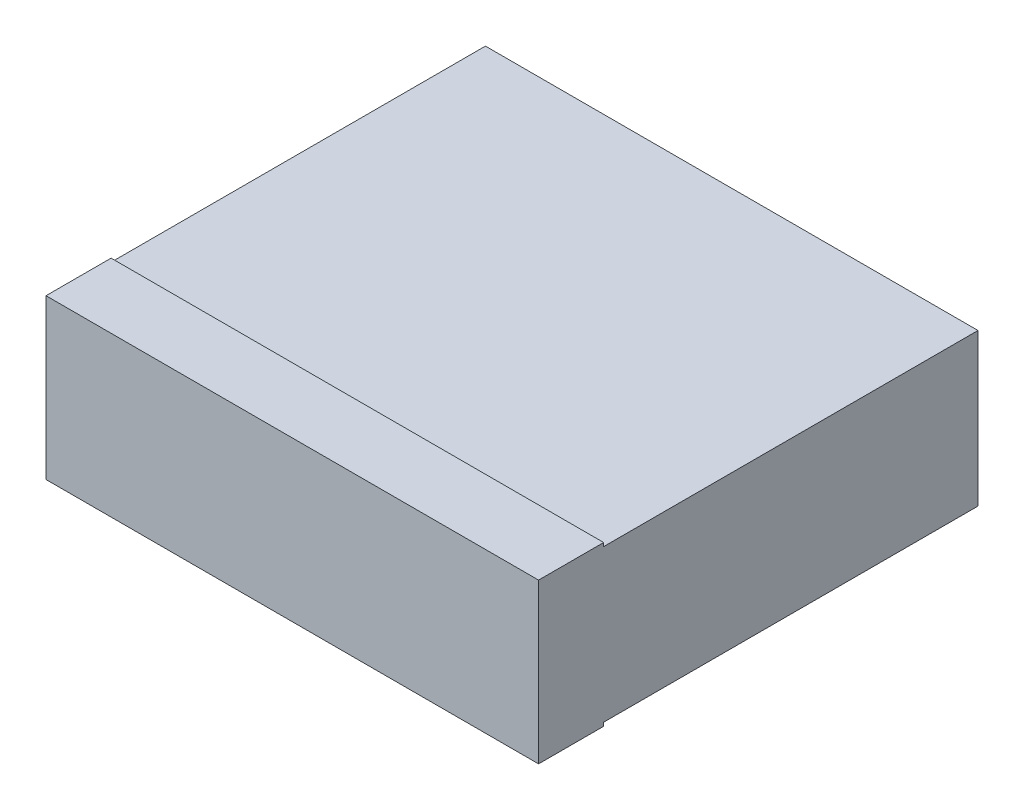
ISO-10303-21;
HEADER;
FILE_DESCRIPTION(('STEP AP214'),'2;1');
FILE_NAME('part.step','',(''),(''),'','','');
FILE_SCHEMA(('AUTOMOTIVE_DESIGN { 1 0 10303 214 1 1 1 1 }'));
ENDSEC;
DATA;
#1=APPLICATION_CONTEXT('core data for automotive mechanical design processes');
#2=APPLICATION_PROTOCOL_DEFINITION('international standard','automotive_design',2000,#1);
#3=PRODUCT_CONTEXT('',#1,'mechanical');
#4=PRODUCT('Part','Part','',(#3));
#5=PRODUCT_RELATED_PRODUCT_CATEGORY('part','',(#4));
#6=PRODUCT_DEFINITION_FORMATION('','',#4);
#7=PRODUCT_DEFINITION_CONTEXT('part definition',#1,'design');
#8=PRODUCT_DEFINITION('design','',#6,#7);
#9=PRODUCT_DEFINITION_SHAPE('','',#8);
#10=(LENGTH_UNIT() NAMED_UNIT(*) SI_UNIT(.MILLI.,.METRE.));
#11=(NAMED_UNIT(*) PLANE_ANGLE_UNIT() SI_UNIT($,.RADIAN.));
#12=(NAMED_UNIT(*) SI_UNIT($,.STERADIAN.) SOLID_ANGLE_UNIT());
#13=UNCERTAINTY_MEASURE_WITH_UNIT(LENGTH_MEASURE(1.E-05),#10,'distance_accuracy_value','');
#14=(GEOMETRIC_REPRESENTATION_CONTEXT(3) GLOBAL_UNCERTAINTY_ASSIGNED_CONTEXT((#13)) GLOBAL_UNIT_ASSIGNED_CONTEXT((#10,
#11,#12)) REPRESENTATION_CONTEXT('',''));
#15=CARTESIAN_POINT('',(0.,0.,0.));
#16=DIRECTION('',(0.,0.,1.));
#17=DIRECTION('',(1.,0.,0.));
#18=AXIS2_PLACEMENT_3D('',#15,#16,#17);
#19=CARTESIAN_POINT('',(-79.375,24.511,120.65));
#20=DIRECTION('',(0.,1.,0.));
#21=DIRECTION('',(0.,0.,1.));
#22=AXIS2_PLACEMENT_3D('',#19,#20,#21);
#23=PLANE('',#22);
#24=DIRECTION('',(1.,0.,0.));
#25=VECTOR('',#24,1.);
#26=CARTESIAN_POINT('',(-79.375,24.511,0.));
#27=LINE('',#26,#25);
#28=CARTESIAN_POINT('',(-79.375,24.511,0.));
#29=VERTEX_POINT('',#28);
#30=CARTESIAN_POINT('',(79.375,24.511,0.));
#31=VERTEX_POINT('',#30);
#32=EDGE_CURVE('E132',#29,#31,#27,.T.);
#33=ORIENTED_EDGE('',*,*,#32,.F.);
#34=DIRECTION('',(0.,0.,-1.));
#35=VECTOR('',#34,1.);
#36=CARTESIAN_POINT('',(-79.375,24.511,120.65));
#37=LINE('',#36,#35);
#38=CARTESIAN_POINT('',(-79.375,24.511,120.65));
#39=VERTEX_POINT('',#38);
#40=EDGE_CURVE('E11',#39,#29,#37,.T.);
#41=ORIENTED_EDGE('',*,*,#40,.F.);
#42=DIRECTION('',(1.,0.,0.));
#43=VECTOR('',#42,1.);
#44=CARTESIAN_POINT('',(-79.375,24.511,120.65));
#45=LINE('',#44,#43);
#46=CARTESIAN_POINT('',(79.375,24.511,120.65));
#47=VERTEX_POINT('',#46);
#48=EDGE_CURVE('E141',#39,#47,#45,.T.);
#49=ORIENTED_EDGE('',*,*,#48,.T.);
#50=DIRECTION('',(0.,0.,-1.));
#51=VECTOR('',#50,1.);
#52=CARTESIAN_POINT('',(79.375,24.511,120.65));
#53=LINE('',#52,#51);
#54=EDGE_CURVE('E42',#47,#31,#53,.T.);
#55=ORIENTED_EDGE('',*,*,#54,.T.);
#56=EDGE_LOOP('',(#33,#41,#49,#55));
#57=FACE_BOUND('',#56,.T.);
#58=ADVANCED_FACE('F39',(#57),#23,.T.);
#59=CARTESIAN_POINT('',(-79.375,-24.511,120.65));
#60=DIRECTION('',(-1.,0.,0.));
#61=DIRECTION('',(0.,0.,1.));
#62=AXIS2_PLACEMENT_3D('',#59,#60,#61);
#63=PLANE('',#62);
#64=DIRECTION('',(0.,1.,0.));
#65=VECTOR('',#64,1.);
#66=CARTESIAN_POINT('',(-79.375,-24.511,0.));
#67=LINE('',#66,#65);
#68=CARTESIAN_POINT('',(-79.375,-24.511,0.));
#69=VERTEX_POINT('',#68);
#70=EDGE_CURVE('E144',#69,#29,#67,.T.);
#71=ORIENTED_EDGE('',*,*,#70,.F.);
#72=DIRECTION('',(0.,0.,-1.));
#73=VECTOR('',#72,1.);
#74=CARTESIAN_POINT('',(-79.375,-24.511,120.65));
#75=LINE('',#74,#73);
#76=CARTESIAN_POINT('',(-79.375,-24.511,120.65));
#77=VERTEX_POINT('',#76);
#78=EDGE_CURVE('E48',#77,#69,#75,.T.);
#79=ORIENTED_EDGE('',*,*,#78,.F.);
#80=DIRECTION('',(0.,-1.,0.));
#81=VECTOR('',#80,1.);
#82=CARTESIAN_POINT('',(-79.375,-25.654,120.65));
#83=LINE('',#82,#81);
#84=CARTESIAN_POINT('',(-79.375,-25.654,120.65));
#85=VERTEX_POINT('',#84);
#86=EDGE_CURVE('E161',#77,#85,#83,.T.);
#87=ORIENTED_EDGE('',*,*,#86,.T.);
#88=DIRECTION('',(0.,0.,-1.));
#89=VECTOR('',#88,1.);
#90=CARTESIAN_POINT('',(-79.375,-25.654,141.6304));
#91=LINE('',#90,#89);
#92=CARTESIAN_POINT('',(-79.375,-25.654,141.6304));
#93=VERTEX_POINT('',#92);
#94=EDGE_CURVE('E137',#93,#85,#91,.T.);
#95=ORIENTED_EDGE('',*,*,#94,.F.);
#96=DIRECTION('',(0.,-1.,0.));
#97=VECTOR('',#96,1.);
#98=CARTESIAN_POINT('',(-79.375,-25.654,141.6304));
#99=LINE('',#98,#97);
#100=CARTESIAN_POINT('',(-79.375,25.654,141.6304));
#101=VERTEX_POINT('',#100);
#102=EDGE_CURVE('E117',#101,#93,#99,.T.);
#103=ORIENTED_EDGE('',*,*,#102,.F.);
#104=DIRECTION('',(0.,0.,-1.));
#105=VECTOR('',#104,1.);
#106=CARTESIAN_POINT('',(-79.375,25.654,141.6304));
#107=LINE('',#106,#105);
#108=CARTESIAN_POINT('',(-79.375,25.654,120.65));
#109=VERTEX_POINT('',#108);
#110=EDGE_CURVE('E114',#101,#109,#107,.T.);
#111=ORIENTED_EDGE('',*,*,#110,.T.);
#112=EDGE_CURVE('E168',#109,#39,#83,.T.);
#113=ORIENTED_EDGE('',*,*,#112,.T.);
#114=ORIENTED_EDGE('',*,*,#40,.T.);
#115=EDGE_LOOP('',(#71,#79,#87,#95,#103,#111,#113,#114));
#116=FACE_BOUND('',#115,.T.);
#117=ADVANCED_FACE('F158',(#116),#63,.T.);
#118=CARTESIAN_POINT('',(-79.375,-24.511,120.65));
#119=DIRECTION('',(0.,1.,0.));
#120=DIRECTION('',(0.,0.,1.));
#121=AXIS2_PLACEMENT_3D('',#118,#119,#120);
#122=PLANE('',#121);
#123=DIRECTION('',(1.,0.,0.));
#124=VECTOR('',#123,1.);
#125=CARTESIAN_POINT('',(-79.375,-24.511,0.));
#126=LINE('',#125,#124);
#127=CARTESIAN_POINT('',(79.375,-24.511,0.));
#128=VERTEX_POINT('',#127);
#129=EDGE_CURVE('E148',#69,#128,#126,.T.);
#130=ORIENTED_EDGE('',*,*,#129,.T.);
#131=DIRECTION('',(0.,0.,-1.));
#132=VECTOR('',#131,1.);
#133=CARTESIAN_POINT('',(79.375,-24.511,120.65));
#134=LINE('',#133,#132);
#135=CARTESIAN_POINT('',(79.375,-24.511,120.65));
#136=VERTEX_POINT('',#135);
#137=EDGE_CURVE('E152',#136,#128,#134,.T.);
#138=ORIENTED_EDGE('',*,*,#137,.F.);
#139=DIRECTION('',(1.,0.,0.));
#140=VECTOR('',#139,1.);
#141=CARTESIAN_POINT('',(-79.375,-24.511,120.65));
#142=LINE('',#141,#140);
#143=EDGE_CURVE('E143',#77,#136,#142,.T.);
#144=ORIENTED_EDGE('',*,*,#143,.F.);
#145=ORIENTED_EDGE('',*,*,#78,.T.);
#146=EDGE_LOOP('',(#130,#138,#144,#145));
#147=FACE_BOUND('',#146,.T.);
#148=ADVANCED_FACE('F163',(#147),#122,.F.);
#149=CARTESIAN_POINT('',(79.375,-24.511,120.65));
#150=DIRECTION('',(-1.,0.,0.));
#151=DIRECTION('',(0.,0.,1.));
#152=AXIS2_PLACEMENT_3D('',#149,#150,#151);
#153=PLANE('',#152);
#154=DIRECTION('',(0.,1.,0.));
#155=VECTOR('',#154,1.);
#156=CARTESIAN_POINT('',(79.375,-24.511,0.));
#157=LINE('',#156,#155);
#158=EDGE_CURVE('E135',#128,#31,#157,.T.);
#159=ORIENTED_EDGE('',*,*,#158,.T.);
#160=ORIENTED_EDGE('',*,*,#54,.F.);
#161=DIRECTION('',(0.,1.,0.));
#162=VECTOR('',#161,1.);
#163=CARTESIAN_POINT('',(79.375,-25.654,120.65));
#164=LINE('',#163,#162);
#165=CARTESIAN_POINT('',(79.375,25.654,120.65));
#166=VERTEX_POINT('',#165);
#167=EDGE_CURVE('E130',#47,#166,#164,.T.);
#168=ORIENTED_EDGE('',*,*,#167,.T.);
#169=DIRECTION('',(0.,0.,-1.));
#170=VECTOR('',#169,1.);
#171=CARTESIAN_POINT('',(79.375,25.654,141.6304));
#172=LINE('',#171,#170);
#173=CARTESIAN_POINT('',(79.375,25.654,141.6304));
#174=VERTEX_POINT('',#173);
#175=EDGE_CURVE('E112',#174,#166,#172,.T.);
#176=ORIENTED_EDGE('',*,*,#175,.F.);
#177=DIRECTION('',(0.,1.,0.));
#178=VECTOR('',#177,1.);
#179=CARTESIAN_POINT('',(79.375,-25.654,141.6304));
#180=LINE('',#179,#178);
#181=CARTESIAN_POINT('',(79.375,-25.654,141.6304));
#182=VERTEX_POINT('',#181);
#183=EDGE_CURVE('E118',#182,#174,#180,.T.);
#184=ORIENTED_EDGE('',*,*,#183,.F.);
#185=DIRECTION('',(0.,0.,-1.));
#186=VECTOR('',#185,1.);
#187=CARTESIAN_POINT('',(79.375,-25.654,141.6304));
#188=LINE('',#187,#186);
#189=CARTESIAN_POINT('',(79.375,-25.654,120.65));
#190=VERTEX_POINT('',#189);
#191=EDGE_CURVE('E176',#182,#190,#188,.T.);
#192=ORIENTED_EDGE('',*,*,#191,.T.);
#193=EDGE_CURVE('E171',#190,#136,#164,.T.);
#194=ORIENTED_EDGE('',*,*,#193,.T.);
#195=ORIENTED_EDGE('',*,*,#137,.T.);
#196=EDGE_LOOP('',(#159,#160,#168,#176,#184,#192,#194,#195));
#197=FACE_BOUND('',#196,.T.);
#198=ADVANCED_FACE('F128',(#197),#153,.F.);
#199=CARTESIAN_POINT('',(0.,0.,0.));
#200=DIRECTION('',(0.,0.,1.));
#201=DIRECTION('',(1.,0.,0.));
#202=AXIS2_PLACEMENT_3D('',#199,#200,#201);
#203=PLANE('',#202);
#204=ORIENTED_EDGE('',*,*,#32,.T.);
#205=ORIENTED_EDGE('',*,*,#158,.F.);
#206=ORIENTED_EDGE('',*,*,#129,.F.);
#207=ORIENTED_EDGE('',*,*,#70,.T.);
#208=EDGE_LOOP('',(#204,#205,#206,#207));
#209=FACE_BOUND('',#208,.T.);
#210=ADVANCED_FACE('F157',(#209),#203,.F.);
#211=CARTESIAN_POINT('',(0.,0.,120.65));
#212=DIRECTION('',(0.,0.,-1.));
#213=DIRECTION('',(-1.,0.,0.));
#214=AXIS2_PLACEMENT_3D('',#211,#212,#213);
#215=PLANE('',#214);
#216=ORIENTED_EDGE('',*,*,#48,.F.);
#217=ORIENTED_EDGE('',*,*,#112,.F.);
#218=DIRECTION('',(-1.,0.,0.));
#219=VECTOR('',#218,1.);
#220=CARTESIAN_POINT('',(-79.375,25.654,120.65));
#221=LINE('',#220,#219);
#222=EDGE_CURVE('E169',#166,#109,#221,.T.);
#223=ORIENTED_EDGE('',*,*,#222,.F.);
#224=ORIENTED_EDGE('',*,*,#167,.F.);
#225=EDGE_LOOP('',(#216,#217,#223,#224));
#226=FACE_BOUND('',#225,.T.);
#227=ADVANCED_FACE('F183',(#226),#215,.T.);
#228=CARTESIAN_POINT('',(-79.375,25.654,141.6304));
#229=DIRECTION('',(0.,-1.,0.));
#230=DIRECTION('',(0.,0.,-1.));
#231=AXIS2_PLACEMENT_3D('',#228,#229,#230);
#232=PLANE('',#231);
#233=ORIENTED_EDGE('',*,*,#222,.T.);
#234=ORIENTED_EDGE('',*,*,#110,.F.);
#235=DIRECTION('',(-1.,0.,0.));
#236=VECTOR('',#235,1.);
#237=CARTESIAN_POINT('',(-79.375,25.654,141.6304));
#238=LINE('',#237,#236);
#239=EDGE_CURVE('E108',#174,#101,#238,.T.);
#240=ORIENTED_EDGE('',*,*,#239,.F.);
#241=ORIENTED_EDGE('',*,*,#175,.T.);
#242=EDGE_LOOP('',(#233,#234,#240,#241));
#243=FACE_BOUND('',#242,.T.);
#244=ADVANCED_FACE('F110',(#243),#232,.F.);
#245=CARTESIAN_POINT('',(-79.375,-25.654,141.6304));
#246=DIRECTION('',(0.,1.,0.));
#247=DIRECTION('',(0.,0.,1.));
#248=AXIS2_PLACEMENT_3D('',#245,#246,#247);
#249=PLANE('',#248);
#250=DIRECTION('',(1.,0.,0.));
#251=VECTOR('',#250,1.);
#252=CARTESIAN_POINT('',(-79.375,-25.654,120.65));
#253=LINE('',#252,#251);
#254=EDGE_CURVE('E126',#85,#190,#253,.T.);
#255=ORIENTED_EDGE('',*,*,#254,.T.);
#256=ORIENTED_EDGE('',*,*,#191,.F.);
#257=DIRECTION('',(1.,0.,0.));
#258=VECTOR('',#257,1.);
#259=CARTESIAN_POINT('',(-79.375,-25.654,141.6304));
#260=LINE('',#259,#258);
#261=EDGE_CURVE('E123',#93,#182,#260,.T.);
#262=ORIENTED_EDGE('',*,*,#261,.F.);
#263=ORIENTED_EDGE('',*,*,#94,.T.);
#264=EDGE_LOOP('',(#255,#256,#262,#263));
#265=FACE_BOUND('',#264,.T.);
#266=ADVANCED_FACE('F178',(#265),#249,.F.);
#267=CARTESIAN_POINT('',(0.,0.,141.6304));
#268=DIRECTION('',(0.,0.,-1.));
#269=DIRECTION('',(-1.,0.,0.));
#270=AXIS2_PLACEMENT_3D('',#267,#268,#269);
#271=PLANE('',#270);
#272=ORIENTED_EDGE('',*,*,#183,.T.);
#273=ORIENTED_EDGE('',*,*,#239,.T.);
#274=ORIENTED_EDGE('',*,*,#102,.T.);
#275=ORIENTED_EDGE('',*,*,#261,.T.);
#276=EDGE_LOOP('',(#272,#273,#274,#275));
#277=FACE_BOUND('',#276,.T.);
#278=ADVANCED_FACE('F121',(#277),#271,.F.);
#279=ORIENTED_EDGE('',*,*,#86,.F.);
#280=ORIENTED_EDGE('',*,*,#143,.T.);
#281=ORIENTED_EDGE('',*,*,#193,.F.);
#282=ORIENTED_EDGE('',*,*,#254,.F.);
#283=EDGE_LOOP('',(#279,#280,#281,#282));
#284=FACE_BOUND('',#283,.T.);
#285=ADVANCED_FACE('F167',(#284),#215,.T.);
#286=CLOSED_SHELL('',(#58,#117,#148,#198,#210,#227,#244,#266,#278,#285));
#287=MANIFOLD_SOLID_BREP('B2',#286);
#288=ADVANCED_BREP_SHAPE_REPRESENTATION('',(#18,#287),#14);
#289=SHAPE_DEFINITION_REPRESENTATION(#9,#288);
ENDSEC;
END-ISO-10303-21;
